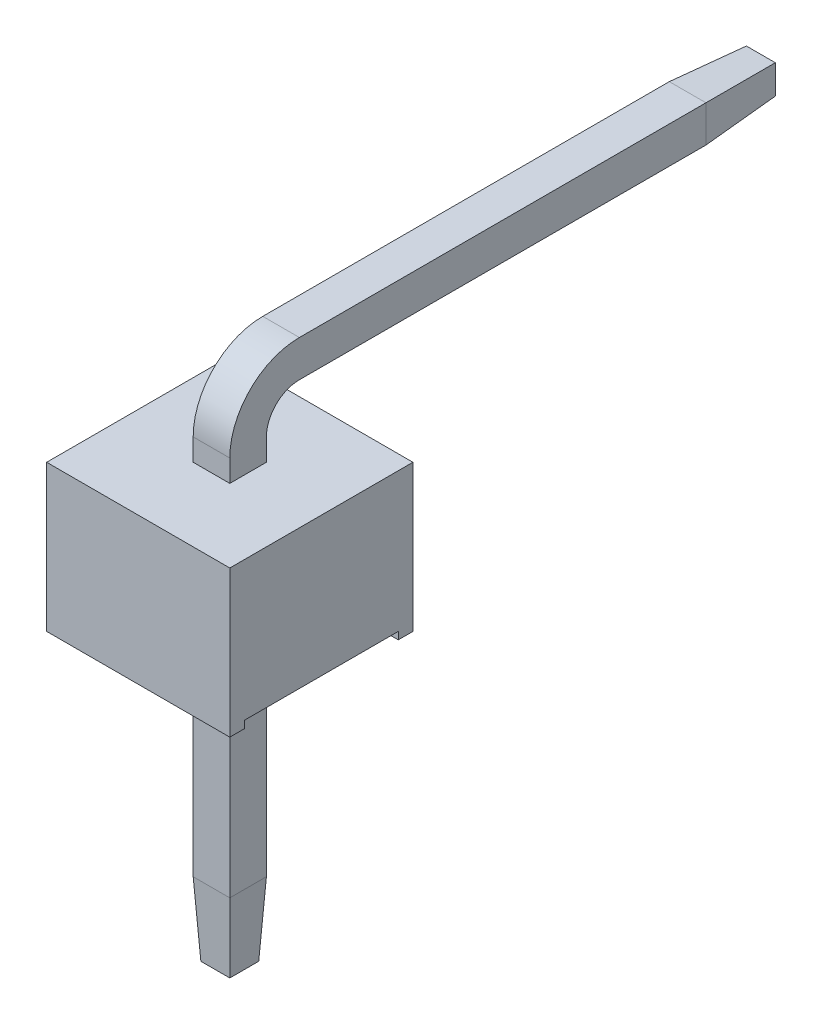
ISO-10303-21;
HEADER;
FILE_DESCRIPTION(('STEP AP214'),'2;1');
FILE_NAME('part.step','',(''),(''),'','','');
FILE_SCHEMA(('AUTOMOTIVE_DESIGN { 1 0 10303 214 1 1 1 1 }'));
ENDSEC;
DATA;
#1=APPLICATION_CONTEXT('core data for automotive mechanical design processes');
#2=APPLICATION_PROTOCOL_DEFINITION('international standard','automotive_design',2000,#1);
#3=PRODUCT_CONTEXT('',#1,'mechanical');
#4=PRODUCT('Part','Part','',(#3));
#5=PRODUCT_RELATED_PRODUCT_CATEGORY('part','',(#4));
#6=PRODUCT_DEFINITION_FORMATION('','',#4);
#7=PRODUCT_DEFINITION_CONTEXT('part definition',#1,'design');
#8=PRODUCT_DEFINITION('design','',#6,#7);
#9=PRODUCT_DEFINITION_SHAPE('','',#8);
#10=(LENGTH_UNIT() NAMED_UNIT(*) SI_UNIT(.MILLI.,.METRE.));
#11=(NAMED_UNIT(*) PLANE_ANGLE_UNIT() SI_UNIT($,.RADIAN.));
#12=(NAMED_UNIT(*) SI_UNIT($,.STERADIAN.) SOLID_ANGLE_UNIT());
#13=UNCERTAINTY_MEASURE_WITH_UNIT(LENGTH_MEASURE(1.E-05),#10,'distance_accuracy_value','');
#14=(GEOMETRIC_REPRESENTATION_CONTEXT(3) GLOBAL_UNCERTAINTY_ASSIGNED_CONTEXT((#13)) GLOBAL_UNIT_ASSIGNED_CONTEXT((#10,
#11,#12)) REPRESENTATION_CONTEXT('',''));
#15=CARTESIAN_POINT('',(0.,0.,0.));
#16=DIRECTION('',(0.,0.,1.));
#17=DIRECTION('',(1.,0.,0.));
#18=AXIS2_PLACEMENT_3D('',#15,#16,#17);
#19=CARTESIAN_POINT('',(0.,2.,0.));
#20=DIRECTION('',(0.,-1.,0.));
#21=DIRECTION('',(0.,0.,-1.));
#22=AXIS2_PLACEMENT_3D('',#19,#20,#21);
#23=PLANE('',#22);
#24=DIRECTION('',(0.,0.,-1.));
#25=VECTOR('',#24,1.);
#26=CARTESIAN_POINT('',(1.25,2.,1.25));
#27=LINE('',#26,#25);
#28=CARTESIAN_POINT('',(1.25,2.,1.25));
#29=VERTEX_POINT('',#28);
#30=CARTESIAN_POINT('',(1.25,2.,-1.25));
#31=VERTEX_POINT('',#30);
#32=EDGE_CURVE('E319',#29,#31,#27,.T.);
#33=ORIENTED_EDGE('',*,*,#32,.T.);
#34=DIRECTION('',(-1.,0.,0.));
#35=VECTOR('',#34,1.);
#36=CARTESIAN_POINT('',(-1.25,2.,-1.25));
#37=LINE('',#36,#35);
#38=CARTESIAN_POINT('',(-1.25,2.,-1.25));
#39=VERTEX_POINT('',#38);
#40=EDGE_CURVE('E322',#31,#39,#37,.T.);
#41=ORIENTED_EDGE('',*,*,#40,.T.);
#42=DIRECTION('',(0.,0.,1.));
#43=VECTOR('',#42,1.);
#44=CARTESIAN_POINT('',(-1.25,2.,1.25));
#45=LINE('',#44,#43);
#46=CARTESIAN_POINT('',(-1.25,2.,1.25));
#47=VERTEX_POINT('',#46);
#48=EDGE_CURVE('E325',#39,#47,#45,.T.);
#49=ORIENTED_EDGE('',*,*,#48,.T.);
#50=DIRECTION('',(1.,0.,0.));
#51=VECTOR('',#50,1.);
#52=CARTESIAN_POINT('',(-1.25,2.,1.25));
#53=LINE('',#52,#51);
#54=EDGE_CURVE('E327',#47,#29,#53,.T.);
#55=ORIENTED_EDGE('',*,*,#54,.T.);
#56=EDGE_LOOP('',(#33,#41,#49,#55));
#57=FACE_BOUND('',#56,.T.);
#58=DIRECTION('',(0.,0.,1.));
#59=VECTOR('',#58,1.);
#60=CARTESIAN_POINT('',(-0.25,2.,0.25));
#61=LINE('',#60,#59);
#62=CARTESIAN_POINT('',(-0.25,2.,-0.25));
#63=VERTEX_POINT('',#62);
#64=CARTESIAN_POINT('',(-0.25,2.,0.25));
#65=VERTEX_POINT('',#64);
#66=EDGE_CURVE('E205',#63,#65,#61,.T.);
#67=ORIENTED_EDGE('',*,*,#66,.F.);
#68=DIRECTION('',(-1.,0.,0.));
#69=VECTOR('',#68,1.);
#70=CARTESIAN_POINT('',(-0.25,2.,-0.25));
#71=LINE('',#70,#69);
#72=CARTESIAN_POINT('',(0.25,2.,-0.25));
#73=VERTEX_POINT('',#72);
#74=EDGE_CURVE('E705',#73,#63,#71,.T.);
#75=ORIENTED_EDGE('',*,*,#74,.F.);
#76=DIRECTION('',(0.,0.,-1.));
#77=VECTOR('',#76,1.);
#78=CARTESIAN_POINT('',(0.25,2.,-0.25));
#79=LINE('',#78,#77);
#80=CARTESIAN_POINT('',(0.25,2.,0.25));
#81=VERTEX_POINT('',#80);
#82=EDGE_CURVE('E714',#81,#73,#79,.T.);
#83=ORIENTED_EDGE('',*,*,#82,.F.);
#84=DIRECTION('',(1.,0.,0.));
#85=VECTOR('',#84,1.);
#86=CARTESIAN_POINT('',(0.25,2.,0.25));
#87=LINE('',#86,#85);
#88=EDGE_CURVE('E711',#65,#81,#87,.T.);
#89=ORIENTED_EDGE('',*,*,#88,.F.);
#90=EDGE_LOOP('',(#67,#75,#83,#89));
#91=FACE_BOUND('',#90,.T.);
#92=ADVANCED_FACE('F37',(#57,#91),#23,.F.);
#93=CARTESIAN_POINT('',(0.,0.1,0.));
#94=DIRECTION('',(0.,1.,0.));
#95=DIRECTION('',(0.,0.,1.));
#96=AXIS2_PLACEMENT_3D('',#93,#94,#95);
#97=PLANE('',#96);
#98=DIRECTION('',(0.,0.,1.));
#99=VECTOR('',#98,1.);
#100=CARTESIAN_POINT('',(1.25,0.1,-1.05));
#101=LINE('',#100,#99);
#102=CARTESIAN_POINT('',(1.25,0.1,-1.05));
#103=VERTEX_POINT('',#102);
#104=CARTESIAN_POINT('',(1.25,0.1,1.05));
#105=VERTEX_POINT('',#104);
#106=EDGE_CURVE('E294',#103,#105,#101,.T.);
#107=ORIENTED_EDGE('',*,*,#106,.T.);
#108=DIRECTION('',(-1.,0.,0.));
#109=VECTOR('',#108,1.);
#110=CARTESIAN_POINT('',(-1.25,0.1,1.05));
#111=LINE('',#110,#109);
#112=CARTESIAN_POINT('',(-1.25,0.1,1.05));
#113=VERTEX_POINT('',#112);
#114=EDGE_CURVE('E297',#105,#113,#111,.T.);
#115=ORIENTED_EDGE('',*,*,#114,.T.);
#116=DIRECTION('',(0.,0.,-1.));
#117=VECTOR('',#116,1.);
#118=CARTESIAN_POINT('',(-1.25,0.1,-1.05));
#119=LINE('',#118,#117);
#120=CARTESIAN_POINT('',(-1.25,0.1,-1.05));
#121=VERTEX_POINT('',#120);
#122=EDGE_CURVE('E301',#113,#121,#119,.T.);
#123=ORIENTED_EDGE('',*,*,#122,.T.);
#124=DIRECTION('',(1.,0.,0.));
#125=VECTOR('',#124,1.);
#126=CARTESIAN_POINT('',(-1.25,0.1,-1.05));
#127=LINE('',#126,#125);
#128=EDGE_CURVE('E303',#121,#103,#127,.T.);
#129=ORIENTED_EDGE('',*,*,#128,.T.);
#130=EDGE_LOOP('',(#107,#115,#123,#129));
#131=FACE_BOUND('',#130,.T.);
#132=DIRECTION('',(0.,0.,1.));
#133=VECTOR('',#132,1.);
#134=CARTESIAN_POINT('',(0.25,0.1,-0.25));
#135=LINE('',#134,#133);
#136=CARTESIAN_POINT('',(0.25,0.1,-0.25));
#137=VERTEX_POINT('',#136);
#138=CARTESIAN_POINT('',(0.25,0.1,0.25));
#139=VERTEX_POINT('',#138);
#140=EDGE_CURVE('E260',#137,#139,#135,.T.);
#141=ORIENTED_EDGE('',*,*,#140,.F.);
#142=DIRECTION('',(1.,0.,0.));
#143=VECTOR('',#142,1.);
#144=CARTESIAN_POINT('',(-0.25,0.1,-0.25));
#145=LINE('',#144,#143);
#146=CARTESIAN_POINT('',(-0.25,0.1,-0.25));
#147=VERTEX_POINT('',#146);
#148=EDGE_CURVE('E282',#147,#137,#145,.T.);
#149=ORIENTED_EDGE('',*,*,#148,.F.);
#150=DIRECTION('',(0.,0.,-1.));
#151=VECTOR('',#150,1.);
#152=CARTESIAN_POINT('',(-0.25,0.1,-0.25));
#153=LINE('',#152,#151);
#154=CARTESIAN_POINT('',(-0.25,0.1,0.25));
#155=VERTEX_POINT('',#154);
#156=EDGE_CURVE('E279',#155,#147,#153,.T.);
#157=ORIENTED_EDGE('',*,*,#156,.F.);
#158=DIRECTION('',(-1.,0.,0.));
#159=VECTOR('',#158,1.);
#160=CARTESIAN_POINT('',(-0.25,0.1,0.25));
#161=LINE('',#160,#159);
#162=EDGE_CURVE('E276',#139,#155,#161,.T.);
#163=ORIENTED_EDGE('',*,*,#162,.F.);
#164=EDGE_LOOP('',(#141,#149,#157,#163));
#165=FACE_BOUND('',#164,.T.);
#166=ADVANCED_FACE('F366',(#131,#165),#97,.F.);
#167=CARTESIAN_POINT('',(0.,0.,0.));
#168=DIRECTION('',(0.,-1.,0.));
#169=DIRECTION('',(0.,0.,-1.));
#170=AXIS2_PLACEMENT_3D('',#167,#168,#169);
#171=PLANE('',#170);
#172=DIRECTION('',(1.,0.,0.));
#173=VECTOR('',#172,1.);
#174=CARTESIAN_POINT('',(-1.25,0.,-1.05));
#175=LINE('',#174,#173);
#176=CARTESIAN_POINT('',(-1.25,0.,-1.05));
#177=VERTEX_POINT('',#176);
#178=CARTESIAN_POINT('',(1.25,0.,-1.05));
#179=VERTEX_POINT('',#178);
#180=EDGE_CURVE('E298',#177,#179,#175,.T.);
#181=ORIENTED_EDGE('',*,*,#180,.F.);
#182=DIRECTION('',(0.,0.,1.));
#183=VECTOR('',#182,1.);
#184=CARTESIAN_POINT('',(-1.25,0.,1.25));
#185=LINE('',#184,#183);
#186=CARTESIAN_POINT('',(-1.25,0.,-1.25));
#187=VERTEX_POINT('',#186);
#188=EDGE_CURVE('E336',#187,#177,#185,.T.);
#189=ORIENTED_EDGE('',*,*,#188,.F.);
#190=DIRECTION('',(-1.,0.,0.));
#191=VECTOR('',#190,1.);
#192=CARTESIAN_POINT('',(-1.25,0.,-1.25));
#193=LINE('',#192,#191);
#194=CARTESIAN_POINT('',(1.25,0.,-1.25));
#195=VERTEX_POINT('',#194);
#196=EDGE_CURVE('E333',#195,#187,#193,.T.);
#197=ORIENTED_EDGE('',*,*,#196,.F.);
#198=DIRECTION('',(0.,0.,-1.));
#199=VECTOR('',#198,1.);
#200=CARTESIAN_POINT('',(1.25,0.,1.25));
#201=LINE('',#200,#199);
#202=EDGE_CURVE('E312',#179,#195,#201,.T.);
#203=ORIENTED_EDGE('',*,*,#202,.F.);
#204=EDGE_LOOP('',(#181,#189,#197,#203));
#205=FACE_BOUND('',#204,.T.);
#206=ADVANCED_FACE('F356',(#205),#171,.T.);
#207=CARTESIAN_POINT('',(1.25,2.,1.25));
#208=DIRECTION('',(-1.,0.,0.));
#209=DIRECTION('',(0.,0.,1.));
#210=AXIS2_PLACEMENT_3D('',#207,#208,#209);
#211=PLANE('',#210);
#212=ORIENTED_EDGE('',*,*,#106,.F.);
#213=DIRECTION('',(0.,-1.,0.));
#214=VECTOR('',#213,1.);
#215=CARTESIAN_POINT('',(1.25,0.1,-1.05));
#216=LINE('',#215,#214);
#217=EDGE_CURVE('E309',#103,#179,#216,.T.);
#218=ORIENTED_EDGE('',*,*,#217,.T.);
#219=ORIENTED_EDGE('',*,*,#202,.T.);
#220=DIRECTION('',(0.,-1.,0.));
#221=VECTOR('',#220,1.);
#222=CARTESIAN_POINT('',(1.25,2.,-1.25));
#223=LINE('',#222,#221);
#224=EDGE_CURVE('E12',#31,#195,#223,.T.);
#225=ORIENTED_EDGE('',*,*,#224,.F.);
#226=ORIENTED_EDGE('',*,*,#32,.F.);
#227=DIRECTION('',(0.,-1.,0.));
#228=VECTOR('',#227,1.);
#229=CARTESIAN_POINT('',(1.25,2.,1.25));
#230=LINE('',#229,#228);
#231=CARTESIAN_POINT('',(1.25,0.,1.25));
#232=VERTEX_POINT('',#231);
#233=EDGE_CURVE('E329',#29,#232,#230,.T.);
#234=ORIENTED_EDGE('',*,*,#233,.T.);
#235=CARTESIAN_POINT('',(1.25,0.,1.05));
#236=VERTEX_POINT('',#235);
#237=EDGE_CURVE('E330',#232,#236,#201,.T.);
#238=ORIENTED_EDGE('',*,*,#237,.T.);
#239=DIRECTION('',(0.,-1.,0.));
#240=VECTOR('',#239,1.);
#241=CARTESIAN_POINT('',(1.25,0.1,1.05));
#242=LINE('',#241,#240);
#243=EDGE_CURVE('E306',#105,#236,#242,.T.);
#244=ORIENTED_EDGE('',*,*,#243,.F.);
#245=EDGE_LOOP('',(#212,#218,#219,#225,#226,#234,#238,#244));
#246=FACE_BOUND('',#245,.T.);
#247=ADVANCED_FACE('F39',(#246),#211,.F.);
#248=CARTESIAN_POINT('',(-1.25,2.,-1.25));
#249=DIRECTION('',(0.,0.,1.));
#250=DIRECTION('',(1.,0.,0.));
#251=AXIS2_PLACEMENT_3D('',#248,#249,#250);
#252=PLANE('',#251);
#253=ORIENTED_EDGE('',*,*,#196,.T.);
#254=DIRECTION('',(0.,-1.,0.));
#255=VECTOR('',#254,1.);
#256=CARTESIAN_POINT('',(-1.25,2.,-1.25));
#257=LINE('',#256,#255);
#258=EDGE_CURVE('E45',#39,#187,#257,.T.);
#259=ORIENTED_EDGE('',*,*,#258,.F.);
#260=ORIENTED_EDGE('',*,*,#40,.F.);
#261=ORIENTED_EDGE('',*,*,#224,.T.);
#262=EDGE_LOOP('',(#253,#259,#260,#261));
#263=FACE_BOUND('',#262,.T.);
#264=ADVANCED_FACE('F383',(#263),#252,.F.);
#265=CARTESIAN_POINT('',(-1.25,2.,1.25));
#266=DIRECTION('',(1.,0.,0.));
#267=DIRECTION('',(0.,0.,-1.));
#268=AXIS2_PLACEMENT_3D('',#265,#266,#267);
#269=PLANE('',#268);
#270=ORIENTED_EDGE('',*,*,#188,.T.);
#271=DIRECTION('',(0.,-1.,0.));
#272=VECTOR('',#271,1.);
#273=CARTESIAN_POINT('',(-1.25,0.1,-1.05));
#274=LINE('',#273,#272);
#275=EDGE_CURVE('E313',#121,#177,#274,.T.);
#276=ORIENTED_EDGE('',*,*,#275,.F.);
#277=ORIENTED_EDGE('',*,*,#122,.F.);
#278=DIRECTION('',(0.,-1.,0.));
#279=VECTOR('',#278,1.);
#280=CARTESIAN_POINT('',(-1.25,0.1,1.05));
#281=LINE('',#280,#279);
#282=CARTESIAN_POINT('',(-1.25,0.,1.05));
#283=VERTEX_POINT('',#282);
#284=EDGE_CURVE('E315',#113,#283,#281,.T.);
#285=ORIENTED_EDGE('',*,*,#284,.T.);
#286=CARTESIAN_POINT('',(-1.25,0.,1.25));
#287=VERTEX_POINT('',#286);
#288=EDGE_CURVE('E335',#283,#287,#185,.T.);
#289=ORIENTED_EDGE('',*,*,#288,.T.);
#290=DIRECTION('',(0.,-1.,0.));
#291=VECTOR('',#290,1.);
#292=CARTESIAN_POINT('',(-1.25,2.,1.25));
#293=LINE('',#292,#291);
#294=EDGE_CURVE('E342',#47,#287,#293,.T.);
#295=ORIENTED_EDGE('',*,*,#294,.F.);
#296=ORIENTED_EDGE('',*,*,#48,.F.);
#297=ORIENTED_EDGE('',*,*,#258,.T.);
#298=EDGE_LOOP('',(#270,#276,#277,#285,#289,#295,#296,#297));
#299=FACE_BOUND('',#298,.T.);
#300=ADVANCED_FACE('F349',(#299),#269,.F.);
#301=CARTESIAN_POINT('',(-1.25,2.,1.25));
#302=DIRECTION('',(0.,0.,-1.));
#303=DIRECTION('',(-1.,0.,0.));
#304=AXIS2_PLACEMENT_3D('',#301,#302,#303);
#305=PLANE('',#304);
#306=DIRECTION('',(1.,0.,0.));
#307=VECTOR('',#306,1.);
#308=CARTESIAN_POINT('',(-1.25,0.,1.25));
#309=LINE('',#308,#307);
#310=EDGE_CURVE('E323',#287,#232,#309,.T.);
#311=ORIENTED_EDGE('',*,*,#310,.T.);
#312=ORIENTED_EDGE('',*,*,#233,.F.);
#313=ORIENTED_EDGE('',*,*,#54,.F.);
#314=ORIENTED_EDGE('',*,*,#294,.T.);
#315=EDGE_LOOP('',(#311,#312,#313,#314));
#316=FACE_BOUND('',#315,.T.);
#317=ADVANCED_FACE('F378',(#316),#305,.F.);
#318=DIRECTION('',(-1.,0.,0.));
#319=VECTOR('',#318,1.);
#320=CARTESIAN_POINT('',(-1.25,0.,1.05));
#321=LINE('',#320,#319);
#322=EDGE_CURVE('E293',#236,#283,#321,.T.);
#323=ORIENTED_EDGE('',*,*,#322,.F.);
#324=ORIENTED_EDGE('',*,*,#237,.F.);
#325=ORIENTED_EDGE('',*,*,#310,.F.);
#326=ORIENTED_EDGE('',*,*,#288,.F.);
#327=EDGE_LOOP('',(#323,#324,#325,#326));
#328=FACE_BOUND('',#327,.T.);
#329=ADVANCED_FACE('F374',(#328),#171,.T.);
#330=CARTESIAN_POINT('',(-1.25,0.1,-1.05));
#331=DIRECTION('',(0.,0.,-1.));
#332=DIRECTION('',(-1.,0.,0.));
#333=AXIS2_PLACEMENT_3D('',#330,#331,#332);
#334=PLANE('',#333);
#335=ORIENTED_EDGE('',*,*,#180,.T.);
#336=ORIENTED_EDGE('',*,*,#217,.F.);
#337=ORIENTED_EDGE('',*,*,#128,.F.);
#338=ORIENTED_EDGE('',*,*,#275,.T.);
#339=EDGE_LOOP('',(#335,#336,#337,#338));
#340=FACE_BOUND('',#339,.T.);
#341=ADVANCED_FACE('F359',(#340),#334,.F.);
#342=CARTESIAN_POINT('',(-1.25,0.1,1.05));
#343=DIRECTION('',(0.,0.,1.));
#344=DIRECTION('',(1.,0.,0.));
#345=AXIS2_PLACEMENT_3D('',#342,#343,#344);
#346=PLANE('',#345);
#347=ORIENTED_EDGE('',*,*,#322,.T.);
#348=ORIENTED_EDGE('',*,*,#284,.F.);
#349=ORIENTED_EDGE('',*,*,#114,.F.);
#350=ORIENTED_EDGE('',*,*,#243,.T.);
#351=EDGE_LOOP('',(#347,#348,#349,#350));
#352=FACE_BOUND('',#351,.T.);
#353=ADVANCED_FACE('F398',(#352),#346,.F.);
#354=CARTESIAN_POINT('',(0.25,-3.9,-0.25));
#355=DIRECTION('',(-1.,0.,0.));
#356=DIRECTION('',(0.,0.,1.));
#357=AXIS2_PLACEMENT_3D('',#354,#355,#356);
#358=PLANE('',#357);
#359=DIRECTION('',(0.,1.,0.));
#360=VECTOR('',#359,1.);
#361=CARTESIAN_POINT('',(0.25,-3.9,0.25));
#362=LINE('',#361,#360);
#363=CARTESIAN_POINT('',(0.25,-2.9,0.25));
#364=VERTEX_POINT('',#363);
#365=EDGE_CURVE('E291',#364,#139,#362,.T.);
#366=ORIENTED_EDGE('',*,*,#365,.F.);
#367=DIRECTION('',(0.,0.,1.));
#368=VECTOR('',#367,1.);
#369=CARTESIAN_POINT('',(0.25,-2.9,-0.25));
#370=LINE('',#369,#368);
#371=CARTESIAN_POINT('',(0.25,-2.9,-0.25));
#372=VERTEX_POINT('',#371);
#373=EDGE_CURVE('E244',#372,#364,#370,.T.);
#374=ORIENTED_EDGE('',*,*,#373,.F.);
#375=DIRECTION('',(0.,1.,0.));
#376=VECTOR('',#375,1.);
#377=CARTESIAN_POINT('',(0.25,-3.9,-0.25));
#378=LINE('',#377,#376);
#379=EDGE_CURVE('E285',#372,#137,#378,.T.);
#380=ORIENTED_EDGE('',*,*,#379,.T.);
#381=ORIENTED_EDGE('',*,*,#140,.T.);
#382=EDGE_LOOP('',(#366,#374,#380,#381));
#383=FACE_BOUND('',#382,.T.);
#384=ADVANCED_FACE('F423',(#383),#358,.F.);
#385=CARTESIAN_POINT('',(-0.25,-3.9,0.25));
#386=DIRECTION('',(0.,0.,-1.));
#387=DIRECTION('',(-1.,0.,0.));
#388=AXIS2_PLACEMENT_3D('',#385,#386,#387);
#389=PLANE('',#388);
#390=DIRECTION('',(0.,1.,0.));
#391=VECTOR('',#390,1.);
#392=CARTESIAN_POINT('',(-0.25,-3.9,0.25));
#393=LINE('',#392,#391);
#394=CARTESIAN_POINT('',(-0.25,-2.9,0.25));
#395=VERTEX_POINT('',#394);
#396=EDGE_CURVE('E289',#395,#155,#393,.T.);
#397=ORIENTED_EDGE('',*,*,#396,.F.);
#398=DIRECTION('',(-1.,0.,0.));
#399=VECTOR('',#398,1.);
#400=CARTESIAN_POINT('',(0.25,-2.9,0.25));
#401=LINE('',#400,#399);
#402=EDGE_CURVE('E247',#364,#395,#401,.T.);
#403=ORIENTED_EDGE('',*,*,#402,.F.);
#404=ORIENTED_EDGE('',*,*,#365,.T.);
#405=ORIENTED_EDGE('',*,*,#162,.T.);
#406=EDGE_LOOP('',(#397,#403,#404,#405));
#407=FACE_BOUND('',#406,.T.);
#408=ADVANCED_FACE('F430',(#407),#389,.F.);
#409=CARTESIAN_POINT('',(-0.25,-3.9,-0.25));
#410=DIRECTION('',(1.,0.,0.));
#411=DIRECTION('',(0.,0.,-1.));
#412=AXIS2_PLACEMENT_3D('',#409,#410,#411);
#413=PLANE('',#412);
#414=DIRECTION('',(0.,1.,0.));
#415=VECTOR('',#414,1.);
#416=CARTESIAN_POINT('',(-0.25,-3.9,-0.25));
#417=LINE('',#416,#415);
#418=CARTESIAN_POINT('',(-0.25,-2.9,-0.25));
#419=VERTEX_POINT('',#418);
#420=EDGE_CURVE('E287',#419,#147,#417,.T.);
#421=ORIENTED_EDGE('',*,*,#420,.F.);
#422=DIRECTION('',(0.,0.,-1.));
#423=VECTOR('',#422,1.);
#424=CARTESIAN_POINT('',(-0.25,-2.9,0.25));
#425=LINE('',#424,#423);
#426=EDGE_CURVE('E250',#395,#419,#425,.T.);
#427=ORIENTED_EDGE('',*,*,#426,.F.);
#428=ORIENTED_EDGE('',*,*,#396,.T.);
#429=ORIENTED_EDGE('',*,*,#156,.T.);
#430=EDGE_LOOP('',(#421,#427,#428,#429));
#431=FACE_BOUND('',#430,.T.);
#432=ADVANCED_FACE('F438',(#431),#413,.F.);
#433=CARTESIAN_POINT('',(-0.25,-3.9,-0.25));
#434=DIRECTION('',(0.,0.,1.));
#435=DIRECTION('',(1.,0.,0.));
#436=AXIS2_PLACEMENT_3D('',#433,#434,#435);
#437=PLANE('',#436);
#438=ORIENTED_EDGE('',*,*,#379,.F.);
#439=DIRECTION('',(1.,0.,0.));
#440=VECTOR('',#439,1.);
#441=CARTESIAN_POINT('',(-0.25,-2.9,-0.25));
#442=LINE('',#441,#440);
#443=EDGE_CURVE('E241',#419,#372,#442,.T.);
#444=ORIENTED_EDGE('',*,*,#443,.F.);
#445=ORIENTED_EDGE('',*,*,#420,.T.);
#446=ORIENTED_EDGE('',*,*,#148,.T.);
#447=EDGE_LOOP('',(#438,#444,#445,#446));
#448=FACE_BOUND('',#447,.T.);
#449=ADVANCED_FACE('F446',(#448),#437,.F.);
#450=CARTESIAN_POINT('',(-0.25,-2.9,-0.25));
#451=DIRECTION('',(0.,0.0523359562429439,0.998629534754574));
#452=DIRECTION('',(0.,-0.998629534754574,0.0523359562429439));
#453=AXIS2_PLACEMENT_3D('',#450,#451,#452);
#454=PLANE('',#453);
#455=ORIENTED_EDGE('',*,*,#443,.T.);
#456=DIRECTION('',(0.052264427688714,0.997264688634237,-0.052264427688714));
#457=VECTOR('',#456,1.);
#458=CARTESIAN_POINT('',(0.25,-2.9,-0.25));
#459=LINE('',#458,#457);
#460=CARTESIAN_POINT('',(0.197592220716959,-3.9,-0.197592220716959));
#461=VERTEX_POINT('',#460);
#462=EDGE_CURVE('E258',#461,#372,#459,.T.);
#463=ORIENTED_EDGE('',*,*,#462,.F.);
#464=DIRECTION('',(1.,0.,0.));
#465=VECTOR('',#464,1.);
#466=CARTESIAN_POINT('',(-0.25,-3.9,-0.197592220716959));
#467=LINE('',#466,#465);
#468=CARTESIAN_POINT('',(-0.197592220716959,-3.9,-0.197592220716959));
#469=VERTEX_POINT('',#468);
#470=EDGE_CURVE('E252',#469,#461,#467,.T.);
#471=ORIENTED_EDGE('',*,*,#470,.F.);
#472=DIRECTION('',(-0.052264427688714,0.997264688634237,-0.052264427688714));
#473=VECTOR('',#472,1.);
#474=CARTESIAN_POINT('',(-0.25,-2.9,-0.25));
#475=LINE('',#474,#473);
#476=EDGE_CURVE('E253',#469,#419,#475,.T.);
#477=ORIENTED_EDGE('',*,*,#476,.T.);
#478=EDGE_LOOP('',(#455,#463,#471,#477));
#479=FACE_BOUND('',#478,.T.);
#480=ADVANCED_FACE('F454',(#479),#454,.F.);
#481=CARTESIAN_POINT('',(0.25,-2.9,-0.25));
#482=DIRECTION('',(-0.998629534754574,0.0523359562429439,0.));
#483=DIRECTION('',(-0.0523359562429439,-0.998629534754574,0.));
#484=AXIS2_PLACEMENT_3D('',#481,#482,#483);
#485=PLANE('',#484);
#486=ORIENTED_EDGE('',*,*,#373,.T.);
#487=DIRECTION('',(0.052264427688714,0.997264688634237,0.052264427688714));
#488=VECTOR('',#487,1.);
#489=CARTESIAN_POINT('',(0.25,-2.9,0.25));
#490=LINE('',#489,#488);
#491=CARTESIAN_POINT('',(0.197592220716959,-3.9,0.197592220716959));
#492=VERTEX_POINT('',#491);
#493=EDGE_CURVE('E261',#492,#364,#490,.T.);
#494=ORIENTED_EDGE('',*,*,#493,.F.);
#495=DIRECTION('',(0.,0.,1.));
#496=VECTOR('',#495,1.);
#497=CARTESIAN_POINT('',(0.197592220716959,-3.9,-0.25));
#498=LINE('',#497,#496);
#499=EDGE_CURVE('E266',#461,#492,#498,.T.);
#500=ORIENTED_EDGE('',*,*,#499,.F.);
#501=ORIENTED_EDGE('',*,*,#462,.T.);
#502=EDGE_LOOP('',(#486,#494,#500,#501));
#503=FACE_BOUND('',#502,.T.);
#504=ADVANCED_FACE('F462',(#503),#485,.F.);
#505=CARTESIAN_POINT('',(0.25,-2.9,0.25));
#506=DIRECTION('',(0.,0.0523359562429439,-0.998629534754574));
#507=DIRECTION('',(0.,0.998629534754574,0.0523359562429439));
#508=AXIS2_PLACEMENT_3D('',#505,#506,#507);
#509=PLANE('',#508);
#510=ORIENTED_EDGE('',*,*,#402,.T.);
#511=DIRECTION('',(-0.052264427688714,0.997264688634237,0.052264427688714));
#512=VECTOR('',#511,1.);
#513=CARTESIAN_POINT('',(-0.25,-2.9,0.25));
#514=LINE('',#513,#512);
#515=CARTESIAN_POINT('',(-0.197592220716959,-3.9,0.197592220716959));
#516=VERTEX_POINT('',#515);
#517=EDGE_CURVE('E256',#516,#395,#514,.T.);
#518=ORIENTED_EDGE('',*,*,#517,.F.);
#519=DIRECTION('',(-1.,0.,0.));
#520=VECTOR('',#519,1.);
#521=CARTESIAN_POINT('',(0.25,-3.9,0.197592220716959));
#522=LINE('',#521,#520);
#523=EDGE_CURVE('E269',#492,#516,#522,.T.);
#524=ORIENTED_EDGE('',*,*,#523,.F.);
#525=ORIENTED_EDGE('',*,*,#493,.T.);
#526=EDGE_LOOP('',(#510,#518,#524,#525));
#527=FACE_BOUND('',#526,.T.);
#528=ADVANCED_FACE('F470',(#527),#509,.F.);
#529=CARTESIAN_POINT('',(-0.25,-2.9,0.25));
#530=DIRECTION('',(0.998629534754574,0.0523359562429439,0.));
#531=DIRECTION('',(-0.0523359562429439,0.998629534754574,0.));
#532=AXIS2_PLACEMENT_3D('',#529,#530,#531);
#533=PLANE('',#532);
#534=ORIENTED_EDGE('',*,*,#426,.T.);
#535=ORIENTED_EDGE('',*,*,#476,.F.);
#536=DIRECTION('',(0.,0.,-1.));
#537=VECTOR('',#536,1.);
#538=CARTESIAN_POINT('',(-0.197592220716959,-3.9,0.25));
#539=LINE('',#538,#537);
#540=EDGE_CURVE('E257',#516,#469,#539,.T.);
#541=ORIENTED_EDGE('',*,*,#540,.F.);
#542=ORIENTED_EDGE('',*,*,#517,.T.);
#543=EDGE_LOOP('',(#534,#535,#541,#542));
#544=FACE_BOUND('',#543,.T.);
#545=ADVANCED_FACE('F478',(#544),#533,.F.);
#546=CARTESIAN_POINT('',(0.,-3.9,0.));
#547=DIRECTION('',(0.,1.,0.));
#548=DIRECTION('',(0.,0.,1.));
#549=AXIS2_PLACEMENT_3D('',#546,#547,#548);
#550=PLANE('',#549);
#551=ORIENTED_EDGE('',*,*,#540,.T.);
#552=ORIENTED_EDGE('',*,*,#470,.T.);
#553=ORIENTED_EDGE('',*,*,#499,.T.);
#554=ORIENTED_EDGE('',*,*,#523,.T.);
#555=EDGE_LOOP('',(#551,#552,#553,#554));
#556=FACE_BOUND('',#555,.T.);
#557=ADVANCED_FACE('F486',(#556),#550,.F.);
#558=CARTESIAN_POINT('',(0.25,3.25,-0.700000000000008));
#559=DIRECTION('',(0.,1.,0.));
#560=DIRECTION('',(0.,0.,1.));
#561=AXIS2_PLACEMENT_3D('',#558,#559,#560);
#562=PLANE('',#561);
#563=DIRECTION('',(1.,0.,0.));
#564=VECTOR('',#563,1.);
#565=CARTESIAN_POINT('',(-0.25,3.25000000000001,-6.25));
#566=LINE('',#565,#564);
#567=CARTESIAN_POINT('',(-0.25,3.25000000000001,-6.25));
#568=VERTEX_POINT('',#567);
#569=CARTESIAN_POINT('',(0.25,3.25,-6.25));
#570=VERTEX_POINT('',#569);
#571=EDGE_CURVE('E52',#568,#570,#566,.T.);
#572=ORIENTED_EDGE('',*,*,#571,.F.);
#573=DIRECTION('',(0.,0.,-1.));
#574=VECTOR('',#573,1.);
#575=CARTESIAN_POINT('',(-0.25,3.25,-0.700000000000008));
#576=LINE('',#575,#574);
#577=CARTESIAN_POINT('',(-0.25,3.25,-0.700000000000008));
#578=VERTEX_POINT('',#577);
#579=EDGE_CURVE('E223',#578,#568,#576,.T.);
#580=ORIENTED_EDGE('',*,*,#579,.F.);
#581=DIRECTION('',(1.,0.,0.));
#582=VECTOR('',#581,1.);
#583=CARTESIAN_POINT('',(0.25,3.25,-0.700000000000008));
#584=LINE('',#583,#582);
#585=CARTESIAN_POINT('',(0.25,3.25,-0.700000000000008));
#586=VERTEX_POINT('',#585);
#587=EDGE_CURVE('E731',#578,#586,#584,.T.);
#588=ORIENTED_EDGE('',*,*,#587,.T.);
#589=DIRECTION('',(0.,0.,-1.));
#590=VECTOR('',#589,1.);
#591=CARTESIAN_POINT('',(0.25,3.25,-0.700000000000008));
#592=LINE('',#591,#590);
#593=EDGE_CURVE('E232',#586,#570,#592,.T.);
#594=ORIENTED_EDGE('',*,*,#593,.T.);
#595=EDGE_LOOP('',(#572,#580,#588,#594));
#596=FACE_BOUND('',#595,.T.);
#597=ADVANCED_FACE('F494',(#596),#562,.T.);
#598=CARTESIAN_POINT('',(-0.25,2.75,-0.700000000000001));
#599=DIRECTION('',(0.,-1.,0.));
#600=DIRECTION('',(0.,0.,-1.));
#601=AXIS2_PLACEMENT_3D('',#598,#599,#600);
#602=PLANE('',#601);
#603=DIRECTION('',(-1.,0.,0.));
#604=VECTOR('',#603,1.);
#605=CARTESIAN_POINT('',(0.25,2.75000000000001,-6.25));
#606=LINE('',#605,#604);
#607=CARTESIAN_POINT('',(0.25,2.75,-6.25));
#608=VERTEX_POINT('',#607);
#609=CARTESIAN_POINT('',(-0.25,2.75000000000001,-6.25));
#610=VERTEX_POINT('',#609);
#611=EDGE_CURVE('E209',#608,#610,#606,.T.);
#612=ORIENTED_EDGE('',*,*,#611,.F.);
#613=DIRECTION('',(0.,0.,-1.));
#614=VECTOR('',#613,1.);
#615=CARTESIAN_POINT('',(0.25,2.75,-0.700000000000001));
#616=LINE('',#615,#614);
#617=CARTESIAN_POINT('',(0.25,2.75,-0.700000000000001));
#618=VERTEX_POINT('',#617);
#619=EDGE_CURVE('E229',#618,#608,#616,.T.);
#620=ORIENTED_EDGE('',*,*,#619,.F.);
#621=DIRECTION('',(-1.,0.,0.));
#622=VECTOR('',#621,1.);
#623=CARTESIAN_POINT('',(-0.25,2.75,-0.700000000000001));
#624=LINE('',#623,#622);
#625=CARTESIAN_POINT('',(-0.25,2.75,-0.700000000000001));
#626=VERTEX_POINT('',#625);
#627=EDGE_CURVE('E227',#618,#626,#624,.T.);
#628=ORIENTED_EDGE('',*,*,#627,.T.);
#629=DIRECTION('',(0.,0.,-1.));
#630=VECTOR('',#629,1.);
#631=CARTESIAN_POINT('',(-0.25,2.75,-0.700000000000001));
#632=LINE('',#631,#630);
#633=EDGE_CURVE('E220',#626,#610,#632,.T.);
#634=ORIENTED_EDGE('',*,*,#633,.T.);
#635=EDGE_LOOP('',(#612,#620,#628,#634));
#636=FACE_BOUND('',#635,.T.);
#637=ADVANCED_FACE('F225',(#636),#602,.T.);
#638=CARTESIAN_POINT('',(0.,2.3,-0.7));
#639=DIRECTION('',(-1.,0.,0.));
#640=DIRECTION('',(0.,0.,1.));
#641=AXIS2_PLACEMENT_3D('',#638,#639,#640);
#642=CYLINDRICAL_SURFACE('',#641,0.95);
#643=DIRECTION('',(1.,0.,0.));
#644=VECTOR('',#643,1.);
#645=CARTESIAN_POINT('',(0.25,2.3,0.25));
#646=LINE('',#645,#644);
#647=CARTESIAN_POINT('',(-0.25,2.3,0.25));
#648=VERTEX_POINT('',#647);
#649=CARTESIAN_POINT('',(0.25,2.3,0.25));
#650=VERTEX_POINT('',#649);
#651=EDGE_CURVE('E701',#648,#650,#646,.T.);
#652=ORIENTED_EDGE('',*,*,#651,.T.);
#653=CARTESIAN_POINT('',(0.25,2.3,-0.7));
#654=DIRECTION('',(-1.,0.,0.));
#655=DIRECTION('',(0.,0.,1.));
#656=AXIS2_PLACEMENT_3D('',#653,#654,#655);
#657=CIRCLE('',#656,0.95);
#658=EDGE_CURVE('E234',#650,#586,#657,.T.);
#659=ORIENTED_EDGE('',*,*,#658,.T.);
#660=ORIENTED_EDGE('',*,*,#587,.F.);
#661=CARTESIAN_POINT('',(-0.25,2.3,-0.7));
#662=DIRECTION('',(-1.,0.,0.));
#663=DIRECTION('',(0.,0.,1.));
#664=AXIS2_PLACEMENT_3D('',#661,#662,#663);
#665=CIRCLE('',#664,0.95);
#666=EDGE_CURVE('E230',#648,#578,#665,.T.);
#667=ORIENTED_EDGE('',*,*,#666,.F.);
#668=EDGE_LOOP('',(#652,#659,#660,#667));
#669=FACE_BOUND('',#668,.T.);
#670=ADVANCED_FACE('F510',(#669),#642,.T.);
#671=CARTESIAN_POINT('',(0.,2.3,-0.7));
#672=DIRECTION('',(-1.,0.,0.));
#673=DIRECTION('',(0.,0.,1.));
#674=AXIS2_PLACEMENT_3D('',#671,#672,#673);
#675=CYLINDRICAL_SURFACE('',#674,0.45);
#676=DIRECTION('',(-1.,0.,0.));
#677=VECTOR('',#676,1.);
#678=CARTESIAN_POINT('',(-0.25,2.3,-0.25));
#679=LINE('',#678,#677);
#680=CARTESIAN_POINT('',(0.25,2.3,-0.25));
#681=VERTEX_POINT('',#680);
#682=CARTESIAN_POINT('',(-0.25,2.3,-0.25));
#683=VERTEX_POINT('',#682);
#684=EDGE_CURVE('E704',#681,#683,#679,.T.);
#685=ORIENTED_EDGE('',*,*,#684,.T.);
#686=CARTESIAN_POINT('',(-0.25,2.3,-0.7));
#687=DIRECTION('',(-1.,0.,0.));
#688=DIRECTION('',(0.,0.,1.));
#689=AXIS2_PLACEMENT_3D('',#686,#687,#688);
#690=CIRCLE('',#689,0.45);
#691=EDGE_CURVE('E734',#683,#626,#690,.T.);
#692=ORIENTED_EDGE('',*,*,#691,.T.);
#693=ORIENTED_EDGE('',*,*,#627,.F.);
#694=CARTESIAN_POINT('',(0.25,2.3,-0.7));
#695=DIRECTION('',(-1.,0.,0.));
#696=DIRECTION('',(0.,0.,1.));
#697=AXIS2_PLACEMENT_3D('',#694,#695,#696);
#698=CIRCLE('',#697,0.45);
#699=EDGE_CURVE('E736',#681,#618,#698,.T.);
#700=ORIENTED_EDGE('',*,*,#699,.F.);
#701=EDGE_LOOP('',(#685,#692,#693,#700));
#702=FACE_BOUND('',#701,.T.);
#703=ADVANCED_FACE('F518',(#702),#675,.F.);
#704=CARTESIAN_POINT('',(-0.25,2.3,0.25));
#705=DIRECTION('',(1.,0.,0.));
#706=DIRECTION('',(0.,0.,-1.));
#707=AXIS2_PLACEMENT_3D('',#704,#705,#706);
#708=PLANE('',#707);
#709=ORIENTED_EDGE('',*,*,#579,.T.);
#710=DIRECTION('',(0.,1.,0.));
#711=VECTOR('',#710,1.);
#712=CARTESIAN_POINT('',(-0.25,2.75000000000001,-6.25));
#713=LINE('',#712,#711);
#714=EDGE_CURVE('E202',#610,#568,#713,.T.);
#715=ORIENTED_EDGE('',*,*,#714,.F.);
#716=ORIENTED_EDGE('',*,*,#633,.F.);
#717=ORIENTED_EDGE('',*,*,#691,.F.);
#718=DIRECTION('',(0.,-1.,0.));
#719=VECTOR('',#718,1.);
#720=CARTESIAN_POINT('',(-0.25,2.3,-0.25));
#721=LINE('',#720,#719);
#722=EDGE_CURVE('E708',#683,#63,#721,.T.);
#723=ORIENTED_EDGE('',*,*,#722,.T.);
#724=ORIENTED_EDGE('',*,*,#66,.T.);
#725=DIRECTION('',(0.,-1.,0.));
#726=VECTOR('',#725,1.);
#727=CARTESIAN_POINT('',(-0.25,2.3,0.25));
#728=LINE('',#727,#726);
#729=EDGE_CURVE('E727',#648,#65,#728,.T.);
#730=ORIENTED_EDGE('',*,*,#729,.F.);
#731=ORIENTED_EDGE('',*,*,#666,.T.);
#732=EDGE_LOOP('',(#709,#715,#716,#717,#723,#724,#730,#731));
#733=FACE_BOUND('',#732,.T.);
#734=ADVANCED_FACE('F219',(#733),#708,.F.);
#735=CARTESIAN_POINT('',(0.25,2.3,0.25));
#736=DIRECTION('',(0.,0.,-1.));
#737=DIRECTION('',(-1.,0.,0.));
#738=AXIS2_PLACEMENT_3D('',#735,#736,#737);
#739=PLANE('',#738);
#740=ORIENTED_EDGE('',*,*,#88,.T.);
#741=DIRECTION('',(0.,-1.,0.));
#742=VECTOR('',#741,1.);
#743=CARTESIAN_POINT('',(0.25,2.3,0.25));
#744=LINE('',#743,#742);
#745=EDGE_CURVE('E724',#650,#81,#744,.T.);
#746=ORIENTED_EDGE('',*,*,#745,.F.);
#747=ORIENTED_EDGE('',*,*,#651,.F.);
#748=ORIENTED_EDGE('',*,*,#729,.T.);
#749=EDGE_LOOP('',(#740,#746,#747,#748));
#750=FACE_BOUND('',#749,.T.);
#751=ADVANCED_FACE('F533',(#750),#739,.F.);
#752=CARTESIAN_POINT('',(0.25,2.3,-0.25));
#753=DIRECTION('',(-1.,0.,0.));
#754=DIRECTION('',(0.,0.,1.));
#755=AXIS2_PLACEMENT_3D('',#752,#753,#754);
#756=PLANE('',#755);
#757=ORIENTED_EDGE('',*,*,#619,.T.);
#758=DIRECTION('',(0.,-1.,0.));
#759=VECTOR('',#758,1.);
#760=CARTESIAN_POINT('',(0.25,3.25000000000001,-6.25));
#761=LINE('',#760,#759);
#762=EDGE_CURVE('E743',#570,#608,#761,.T.);
#763=ORIENTED_EDGE('',*,*,#762,.F.);
#764=ORIENTED_EDGE('',*,*,#593,.F.);
#765=ORIENTED_EDGE('',*,*,#658,.F.);
#766=ORIENTED_EDGE('',*,*,#745,.T.);
#767=ORIENTED_EDGE('',*,*,#82,.T.);
#768=DIRECTION('',(0.,-1.,0.));
#769=VECTOR('',#768,1.);
#770=CARTESIAN_POINT('',(0.25,2.3,-0.25));
#771=LINE('',#770,#769);
#772=EDGE_CURVE('E721',#681,#73,#771,.T.);
#773=ORIENTED_EDGE('',*,*,#772,.F.);
#774=ORIENTED_EDGE('',*,*,#699,.T.);
#775=EDGE_LOOP('',(#757,#763,#764,#765,#766,#767,#773,#774));
#776=FACE_BOUND('',#775,.T.);
#777=ADVANCED_FACE('F540',(#776),#756,.F.);
#778=CARTESIAN_POINT('',(-0.25,2.3,-0.25));
#779=DIRECTION('',(0.,0.,1.));
#780=DIRECTION('',(1.,0.,0.));
#781=AXIS2_PLACEMENT_3D('',#778,#779,#780);
#782=PLANE('',#781);
#783=ORIENTED_EDGE('',*,*,#74,.T.);
#784=ORIENTED_EDGE('',*,*,#722,.F.);
#785=ORIENTED_EDGE('',*,*,#684,.F.);
#786=ORIENTED_EDGE('',*,*,#772,.T.);
#787=EDGE_LOOP('',(#783,#784,#785,#786));
#788=FACE_BOUND('',#787,.T.);
#789=ADVANCED_FACE('F547',(#788),#782,.F.);
#790=CARTESIAN_POINT('',(0.25,2.75000000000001,-6.25));
#791=DIRECTION('',(0.,0.998629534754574,0.0523359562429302));
#792=DIRECTION('',(0.,-0.0523359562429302,0.998629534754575));
#793=AXIS2_PLACEMENT_3D('',#790,#791,#792);
#794=PLANE('',#793);
#795=ORIENTED_EDGE('',*,*,#611,.T.);
#796=DIRECTION('',(-0.052264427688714,-0.0522644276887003,0.997264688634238));
#797=VECTOR('',#796,1.);
#798=CARTESIAN_POINT('',(-0.25,2.75000000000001,-6.25));
#799=LINE('',#798,#797);
#800=CARTESIAN_POINT('',(-0.197592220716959,2.80240777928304,-7.25));
#801=VERTEX_POINT('',#800);
#802=EDGE_CURVE('E198',#801,#610,#799,.T.);
#803=ORIENTED_EDGE('',*,*,#802,.F.);
#804=DIRECTION('',(-1.,0.,0.));
#805=VECTOR('',#804,1.);
#806=CARTESIAN_POINT('',(0.25,2.80240777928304,-7.25));
#807=LINE('',#806,#805);
#808=CARTESIAN_POINT('',(0.197592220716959,2.80240777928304,-7.25));
#809=VERTEX_POINT('',#808);
#810=EDGE_CURVE('E60',#809,#801,#807,.T.);
#811=ORIENTED_EDGE('',*,*,#810,.F.);
#812=DIRECTION('',(0.052264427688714,-0.0522644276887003,0.997264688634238));
#813=VECTOR('',#812,1.);
#814=CARTESIAN_POINT('',(0.25,2.75000000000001,-6.25));
#815=LINE('',#814,#813);
#816=EDGE_CURVE('E211',#809,#608,#815,.T.);
#817=ORIENTED_EDGE('',*,*,#816,.T.);
#818=EDGE_LOOP('',(#795,#803,#811,#817));
#819=FACE_BOUND('',#818,.T.);
#820=ADVANCED_FACE('F210',(#819),#794,.F.);
#821=CARTESIAN_POINT('',(-0.25,2.75000000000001,-6.25));
#822=DIRECTION('',(0.998629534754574,0.,0.0523359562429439));
#823=DIRECTION('',(0.0523359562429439,0.,-0.998629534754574));
#824=AXIS2_PLACEMENT_3D('',#821,#822,#823);
#825=PLANE('',#824);
#826=ORIENTED_EDGE('',*,*,#714,.T.);
#827=DIRECTION('',(-0.052264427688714,0.0522644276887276,0.997264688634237));
#828=VECTOR('',#827,1.);
#829=CARTESIAN_POINT('',(-0.25,3.25000000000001,-6.25));
#830=LINE('',#829,#828);
#831=CARTESIAN_POINT('',(-0.197592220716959,3.19759222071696,-7.25));
#832=VERTEX_POINT('',#831);
#833=EDGE_CURVE('E206',#832,#568,#830,.T.);
#834=ORIENTED_EDGE('',*,*,#833,.F.);
#835=DIRECTION('',(0.,1.,0.));
#836=VECTOR('',#835,1.);
#837=CARTESIAN_POINT('',(-0.197592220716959,2.75,-7.25));
#838=LINE('',#837,#836);
#839=EDGE_CURVE('E204',#801,#832,#838,.T.);
#840=ORIENTED_EDGE('',*,*,#839,.F.);
#841=ORIENTED_EDGE('',*,*,#802,.T.);
#842=EDGE_LOOP('',(#826,#834,#840,#841));
#843=FACE_BOUND('',#842,.T.);
#844=ADVANCED_FACE('F200',(#843),#825,.F.);
#845=CARTESIAN_POINT('',(-0.25,3.25000000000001,-6.25));
#846=DIRECTION('',(0.,-0.998629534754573,0.0523359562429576));
#847=DIRECTION('',(0.,-0.0523359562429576,-0.998629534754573));
#848=AXIS2_PLACEMENT_3D('',#845,#846,#847);
#849=PLANE('',#848);
#850=ORIENTED_EDGE('',*,*,#571,.T.);
#851=DIRECTION('',(0.052264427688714,0.0522644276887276,0.997264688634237));
#852=VECTOR('',#851,1.);
#853=CARTESIAN_POINT('',(0.25,3.25000000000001,-6.25));
#854=LINE('',#853,#852);
#855=CARTESIAN_POINT('',(0.197592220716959,3.19759222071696,-7.25));
#856=VERTEX_POINT('',#855);
#857=EDGE_CURVE('E694',#856,#570,#854,.T.);
#858=ORIENTED_EDGE('',*,*,#857,.F.);
#859=DIRECTION('',(1.,0.,0.));
#860=VECTOR('',#859,1.);
#861=CARTESIAN_POINT('',(-0.25,3.19759222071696,-7.25));
#862=LINE('',#861,#860);
#863=EDGE_CURVE('E692',#832,#856,#862,.T.);
#864=ORIENTED_EDGE('',*,*,#863,.F.);
#865=ORIENTED_EDGE('',*,*,#833,.T.);
#866=EDGE_LOOP('',(#850,#858,#864,#865));
#867=FACE_BOUND('',#866,.T.);
#868=ADVANCED_FACE('F567',(#867),#849,.F.);
#869=CARTESIAN_POINT('',(0.25,3.25000000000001,-6.25));
#870=DIRECTION('',(-0.998629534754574,0.,0.0523359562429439));
#871=DIRECTION('',(0.0523359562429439,0.,0.998629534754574));
#872=AXIS2_PLACEMENT_3D('',#869,#870,#871);
#873=PLANE('',#872);
#874=ORIENTED_EDGE('',*,*,#762,.T.);
#875=ORIENTED_EDGE('',*,*,#816,.F.);
#876=DIRECTION('',(0.,-1.,0.));
#877=VECTOR('',#876,1.);
#878=CARTESIAN_POINT('',(0.197592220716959,3.25,-7.25));
#879=LINE('',#878,#877);
#880=EDGE_CURVE('E690',#856,#809,#879,.T.);
#881=ORIENTED_EDGE('',*,*,#880,.F.);
#882=ORIENTED_EDGE('',*,*,#857,.T.);
#883=EDGE_LOOP('',(#874,#875,#881,#882));
#884=FACE_BOUND('',#883,.T.);
#885=ADVANCED_FACE('F574',(#884),#873,.F.);
#886=CARTESIAN_POINT('',(0.,3.,-7.25));
#887=DIRECTION('',(0.,0.,1.));
#888=DIRECTION('',(0.,-1.,0.));
#889=AXIS2_PLACEMENT_3D('',#886,#887,#888);
#890=PLANE('',#889);
#891=ORIENTED_EDGE('',*,*,#880,.T.);
#892=ORIENTED_EDGE('',*,*,#810,.T.);
#893=ORIENTED_EDGE('',*,*,#839,.T.);
#894=ORIENTED_EDGE('',*,*,#863,.T.);
#895=EDGE_LOOP('',(#891,#892,#893,#894));
#896=FACE_BOUND('',#895,.T.);
#897=ADVANCED_FACE('F581',(#896),#890,.F.);
#898=CLOSED_SHELL('',(#92,#166,#206,#247,#264,#300,#317,#329,#341,#353,#384,#408,#432,#449,#480,
#504,#528,#545,#557,#597,#637,#670,#703,#734,#751,#777,#789,#820,#844,#868,#885,#897));
#899=MANIFOLD_SOLID_BREP('B2',#898);
#900=ADVANCED_BREP_SHAPE_REPRESENTATION('',(#18,#899),#14);
#901=SHAPE_DEFINITION_REPRESENTATION(#9,#900);
ENDSEC;
END-ISO-10303-21;
